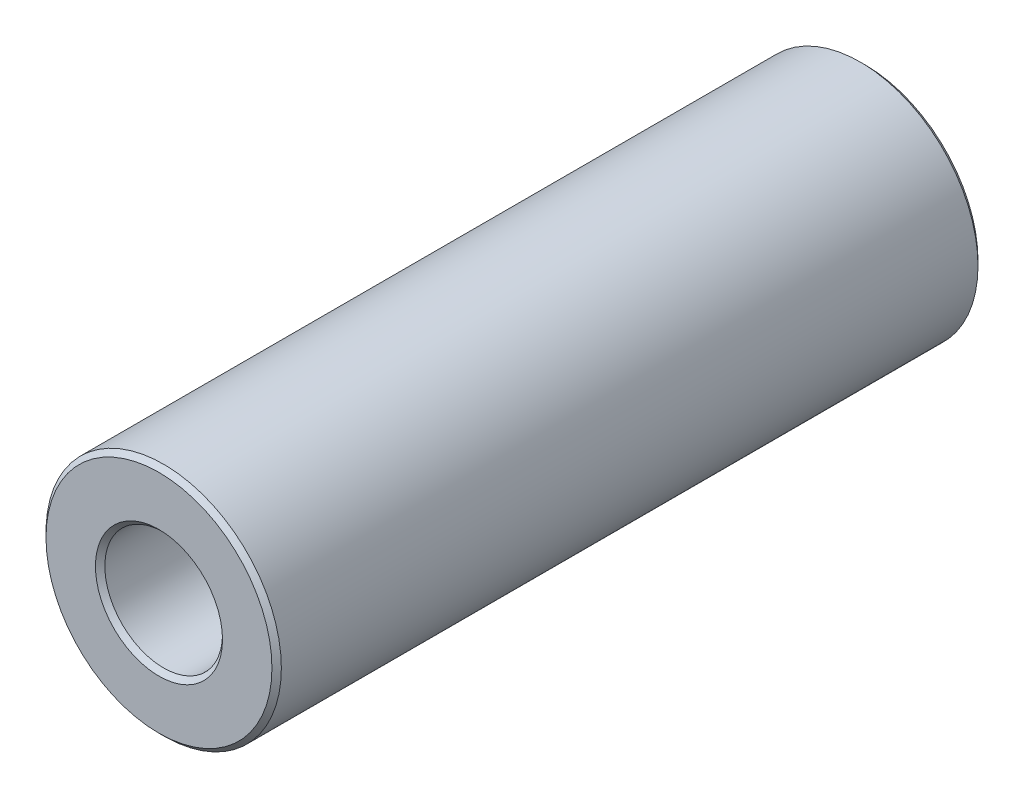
from build123d import *

# Parameters (mm, degrees)
SKETCH1_R           = 2.5
SKETCH1_R_2         = 1.25
BOSS_EXTRUDE2_DEPTH = 7.5
CHAMFER3_SIZE       = 0.1


with BuildPart() as part:
    # Sketch1 → Boss-Extrude2 (new, symmetric)
    with BuildSketch(Plane.XY):
        Circle(SKETCH1_R)
        Circle(SKETCH1_R_2, mode=Mode.SUBTRACT)
    extrude(amount=BOSS_EXTRUDE2_DEPTH, both=True)

    # Chamfer3
    chamfer3_edges = [part.edges().sort_by_distance(p)[0] for p in [
        (-2.5, 0, -7.5),
        (-2.5, 0, 7.5),
        (-1.25, 0, -7.5),
        (-1.25, 0, 7.5),
    ]]
    chamfer(chamfer3_edges, length=CHAMFER3_SIZE)


solid = part.part
